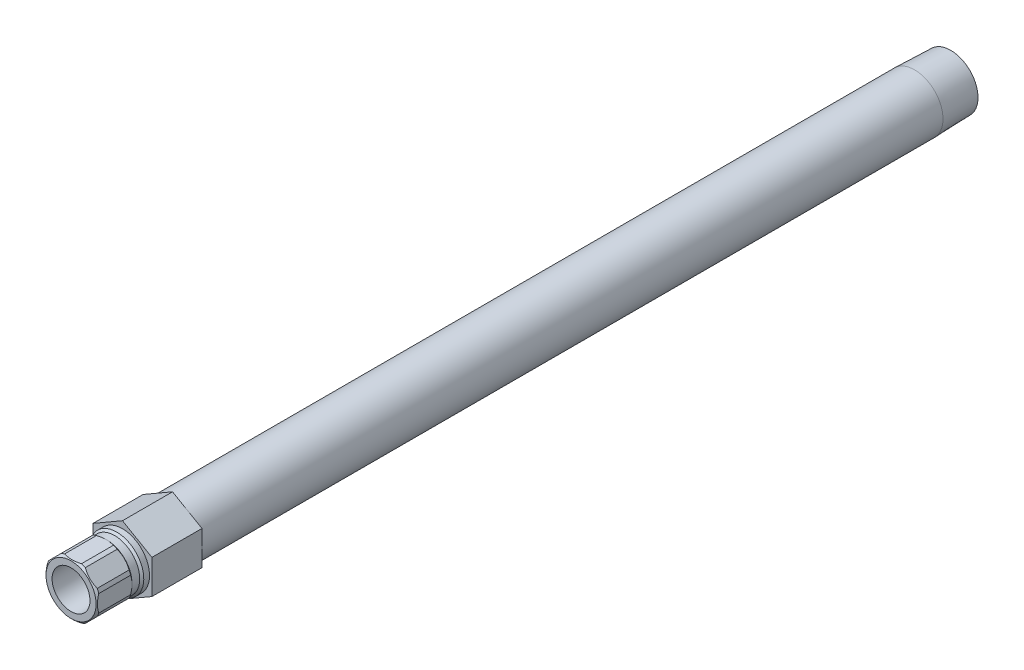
from build123d import *

# Parameters (mm, degrees)
SKETCH2_R           = 7.112
BOSS_EXTRUDE1_DEPTH = 18.796
CUT_EXTRUDE1_START  = 5.8166
SKETCH3_OUTSIDE_W   = 90.482
SKETCH3_OUTSIDE_H   = 93.9
CUT_EXTRUDE1_DEPTH  = 306.537181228


with BuildPart() as part:
    # Sketch1 → Revolve1 (revolve)
    with BuildSketch(Plane(origin=(0, 0, 0), x_dir=(0, 0, -1), z_dir=(1, 0, 0))):
        Polygon((-19.304, 7.112), (-19.304, 9.398), (-18.542, 10.16), (-6.5786, 10.16), (-5.8166, 9.398), (-2.921, 9.398), (-2.159, 10.16), (0, 10.16), (0, 10.668), (297.3324, 10.668), (310.896, 10.244140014), (310.896, 7.8994), (-1.105331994, 7.8994), (-1.524, 7.112), align=None)
    revolve(axis=Axis((0, 0, 0), (0, 0, 1)))

    # Sketch2 → Boss-Extrude1 (add)
    with BuildSketch(Plane.XY):
        Polygon((-11.049, 6.379143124), (-11.049, -6.379143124), (0, -12.758286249), (11.049, -6.379143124), (11.049, 6.379143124), (0, 12.758286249), align=None)
        with Locations(Location((0, 0, 0), (0, 0, 90))):
            Circle(SKETCH2_R, mode=Mode.SUBTRACT)
    extrude(amount=-BOSS_EXTRUDE1_DEPTH)

    # Sketch3 outside → Cut-Extrude1 (cut, through all)
    with BuildSketch(Plane.XY.offset(CUT_EXTRUDE1_START)):
        Rectangle(SKETCH3_OUTSIDE_W, SKETCH3_OUTSIDE_H)
        Polygon((9.652, -3.997989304), (9.652, 3.997989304), (3.997989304, 9.652), (-3.997989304, 9.652), (-9.652, 3.997989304), (-9.652, -3.997989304), (-3.997989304, -9.652), (3.997989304, -9.652), align=None, mode=Mode.SUBTRACT)
    extrude(amount=CUT_EXTRUDE1_DEPTH, mode=Mode.SUBTRACT)


solid = part.part
